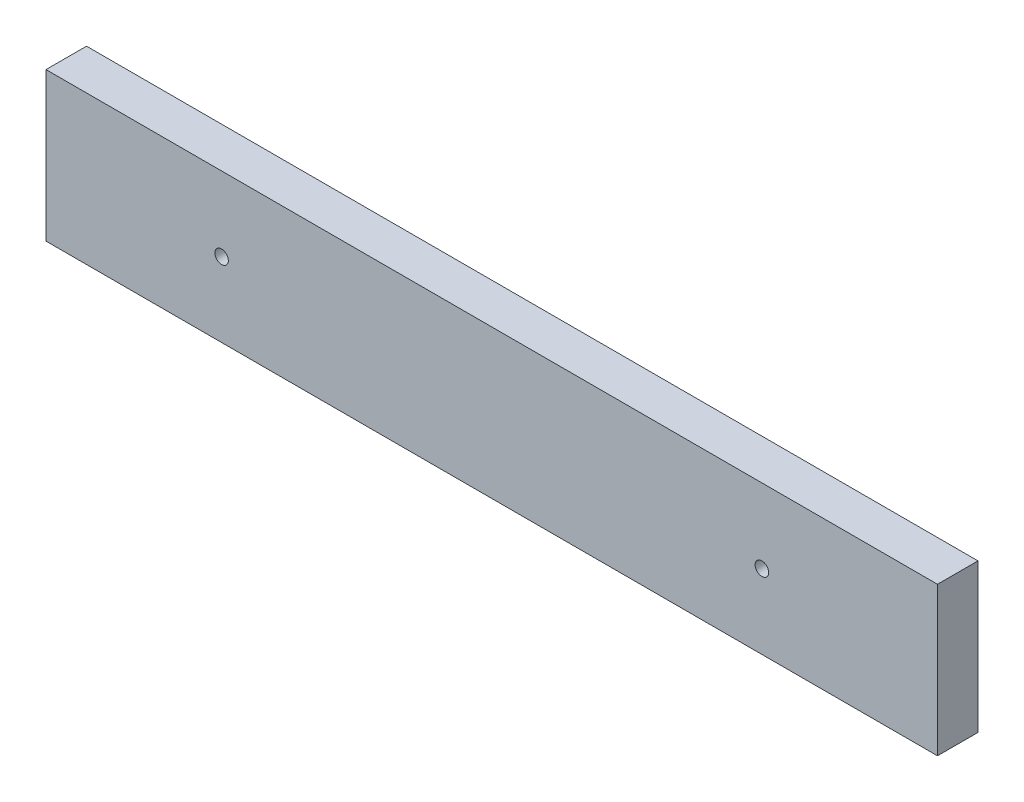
ISO-10303-21;
HEADER;
FILE_DESCRIPTION(('STEP AP214'),'2;1');
FILE_NAME('part.step','',(''),(''),'','','');
FILE_SCHEMA(('AUTOMOTIVE_DESIGN { 1 0 10303 214 1 1 1 1 }'));
ENDSEC;
DATA;
#1=APPLICATION_CONTEXT('core data for automotive mechanical design processes');
#2=APPLICATION_PROTOCOL_DEFINITION('international standard','automotive_design',2000,#1);
#3=PRODUCT_CONTEXT('',#1,'mechanical');
#4=PRODUCT('Part','Part','',(#3));
#5=PRODUCT_RELATED_PRODUCT_CATEGORY('part','',(#4));
#6=PRODUCT_DEFINITION_FORMATION('','',#4);
#7=PRODUCT_DEFINITION_CONTEXT('part definition',#1,'design');
#8=PRODUCT_DEFINITION('design','',#6,#7);
#9=PRODUCT_DEFINITION_SHAPE('','',#8);
#10=(LENGTH_UNIT() NAMED_UNIT(*) SI_UNIT(.MILLI.,.METRE.));
#11=(NAMED_UNIT(*) PLANE_ANGLE_UNIT() SI_UNIT($,.RADIAN.));
#12=(NAMED_UNIT(*) SI_UNIT($,.STERADIAN.) SOLID_ANGLE_UNIT());
#13=UNCERTAINTY_MEASURE_WITH_UNIT(LENGTH_MEASURE(1.E-05),#10,'distance_accuracy_value','');
#14=(GEOMETRIC_REPRESENTATION_CONTEXT(3) GLOBAL_UNCERTAINTY_ASSIGNED_CONTEXT((#13)) GLOBAL_UNIT_ASSIGNED_CONTEXT((#10,
#11,#12)) REPRESENTATION_CONTEXT('',''));
#15=CARTESIAN_POINT('',(0.,0.,0.));
#16=DIRECTION('',(0.,0.,1.));
#17=DIRECTION('',(1.,0.,0.));
#18=AXIS2_PLACEMENT_3D('',#15,#16,#17);
#19=CARTESIAN_POINT('',(838.2,69.85,-19.05));
#20=DIRECTION('',(0.,0.,1.));
#21=DIRECTION('',(0.,-1.,0.));
#22=AXIS2_PLACEMENT_3D('',#19,#20,#21);
#23=PLANE('',#22);
#24=CARTESIAN_POINT('',(165.1,0.,-19.05));
#25=DIRECTION('',(0.,0.,1.));
#26=DIRECTION('',(1.,0.,0.));
#27=AXIS2_PLACEMENT_3D('',#24,#25,#26);
#28=CIRCLE('',#27,6.35);
#29=CARTESIAN_POINT('',(171.45,0.,-19.05));
#30=VERTEX_POINT('',#29);
#31=EDGE_CURVE('E105',#30,#30,#28,.T.);
#32=ORIENTED_EDGE('',*,*,#31,.T.);
#33=EDGE_LOOP('',(#32));
#34=FACE_BOUND('',#33,.T.);
#35=CARTESIAN_POINT('',(673.1,0.,-19.05));
#36=DIRECTION('',(0.,0.,1.));
#37=DIRECTION('',(1.,0.,0.));
#38=AXIS2_PLACEMENT_3D('',#35,#36,#37);
#39=CIRCLE('',#38,6.34999999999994);
#40=CARTESIAN_POINT('',(679.45,0.,-19.05));
#41=VERTEX_POINT('',#40);
#42=EDGE_CURVE('E116',#41,#41,#39,.T.);
#43=ORIENTED_EDGE('',*,*,#42,.T.);
#44=EDGE_LOOP('',(#43));
#45=FACE_BOUND('',#44,.T.);
#46=DIRECTION('',(0.,1.,0.));
#47=VECTOR('',#46,1.);
#48=CARTESIAN_POINT('',(0.,69.85,-19.05));
#49=LINE('',#48,#47);
#50=CARTESIAN_POINT('',(0.,-69.85,-19.05));
#51=VERTEX_POINT('',#50);
#52=CARTESIAN_POINT('',(0.,69.85,-19.05));
#53=VERTEX_POINT('',#52);
#54=EDGE_CURVE('E102',#51,#53,#49,.T.);
#55=ORIENTED_EDGE('',*,*,#54,.T.);
#56=DIRECTION('',(-1.,0.,0.));
#57=VECTOR('',#56,1.);
#58=CARTESIAN_POINT('',(838.2,69.85,-19.05));
#59=LINE('',#58,#57);
#60=CARTESIAN_POINT('',(838.2,69.85,-19.05));
#61=VERTEX_POINT('',#60);
#62=EDGE_CURVE('E11',#61,#53,#59,.T.);
#63=ORIENTED_EDGE('',*,*,#62,.F.);
#64=DIRECTION('',(0.,1.,0.));
#65=VECTOR('',#64,1.);
#66=CARTESIAN_POINT('',(838.2,69.85,-19.05));
#67=LINE('',#66,#65);
#68=CARTESIAN_POINT('',(838.2,-69.85,-19.05));
#69=VERTEX_POINT('',#68);
#70=EDGE_CURVE('E90',#69,#61,#67,.T.);
#71=ORIENTED_EDGE('',*,*,#70,.F.);
#72=DIRECTION('',(-1.,0.,0.));
#73=VECTOR('',#72,1.);
#74=CARTESIAN_POINT('',(838.2,-69.85,-19.05));
#75=LINE('',#74,#73);
#76=EDGE_CURVE('E98',#69,#51,#75,.T.);
#77=ORIENTED_EDGE('',*,*,#76,.T.);
#78=EDGE_LOOP('',(#55,#63,#71,#77));
#79=FACE_BOUND('',#78,.T.);
#80=ADVANCED_FACE('F39',(#34,#45,#79),#23,.F.);
#81=CARTESIAN_POINT('',(838.2,69.85,19.05));
#82=DIRECTION('',(0.,-1.,0.));
#83=DIRECTION('',(0.,0.,-1.));
#84=AXIS2_PLACEMENT_3D('',#81,#82,#83);
#85=PLANE('',#84);
#86=DIRECTION('',(0.,0.,1.));
#87=VECTOR('',#86,1.);
#88=CARTESIAN_POINT('',(0.,69.85,19.05));
#89=LINE('',#88,#87);
#90=CARTESIAN_POINT('',(0.,69.85,19.05));
#91=VERTEX_POINT('',#90);
#92=EDGE_CURVE('E94',#53,#91,#89,.T.);
#93=ORIENTED_EDGE('',*,*,#92,.T.);
#94=DIRECTION('',(-1.,0.,0.));
#95=VECTOR('',#94,1.);
#96=CARTESIAN_POINT('',(838.2,69.85,19.05));
#97=LINE('',#96,#95);
#98=CARTESIAN_POINT('',(838.2,69.85,19.05));
#99=VERTEX_POINT('',#98);
#100=EDGE_CURVE('E47',#99,#91,#97,.T.);
#101=ORIENTED_EDGE('',*,*,#100,.F.);
#102=DIRECTION('',(0.,0.,1.));
#103=VECTOR('',#102,1.);
#104=CARTESIAN_POINT('',(838.2,69.85,19.05));
#105=LINE('',#104,#103);
#106=EDGE_CURVE('E85',#61,#99,#105,.T.);
#107=ORIENTED_EDGE('',*,*,#106,.F.);
#108=ORIENTED_EDGE('',*,*,#62,.T.);
#109=EDGE_LOOP('',(#93,#101,#107,#108));
#110=FACE_BOUND('',#109,.T.);
#111=ADVANCED_FACE('F93',(#110),#85,.F.);
#112=CARTESIAN_POINT('',(838.2,69.85,19.05));
#113=DIRECTION('',(0.,0.,-1.));
#114=DIRECTION('',(0.,1.,0.));
#115=AXIS2_PLACEMENT_3D('',#112,#113,#114);
#116=PLANE('',#115);
#117=CARTESIAN_POINT('',(165.1,0.,19.05));
#118=DIRECTION('',(0.,0.,1.));
#119=DIRECTION('',(1.,0.,0.));
#120=AXIS2_PLACEMENT_3D('',#117,#118,#119);
#121=CIRCLE('',#120,6.35);
#122=CARTESIAN_POINT('',(171.45,0.,19.05));
#123=VERTEX_POINT('',#122);
#124=EDGE_CURVE('E122',#123,#123,#121,.T.);
#125=ORIENTED_EDGE('',*,*,#124,.F.);
#126=EDGE_LOOP('',(#125));
#127=FACE_BOUND('',#126,.T.);
#128=CARTESIAN_POINT('',(673.1,0.,19.05));
#129=DIRECTION('',(0.,0.,1.));
#130=DIRECTION('',(1.,0.,0.));
#131=AXIS2_PLACEMENT_3D('',#128,#129,#130);
#132=CIRCLE('',#131,6.34999999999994);
#133=CARTESIAN_POINT('',(679.45,0.,19.05));
#134=VERTEX_POINT('',#133);
#135=EDGE_CURVE('E119',#134,#134,#132,.T.);
#136=ORIENTED_EDGE('',*,*,#135,.F.);
#137=EDGE_LOOP('',(#136));
#138=FACE_BOUND('',#137,.T.);
#139=DIRECTION('',(0.,-1.,0.));
#140=VECTOR('',#139,1.);
#141=CARTESIAN_POINT('',(0.,69.85,19.05));
#142=LINE('',#141,#140);
#143=CARTESIAN_POINT('',(0.,-69.85,19.05));
#144=VERTEX_POINT('',#143);
#145=EDGE_CURVE('E72',#91,#144,#142,.T.);
#146=ORIENTED_EDGE('',*,*,#145,.T.);
#147=DIRECTION('',(-1.,0.,0.));
#148=VECTOR('',#147,1.);
#149=CARTESIAN_POINT('',(838.2,-69.85,19.05));
#150=LINE('',#149,#148);
#151=CARTESIAN_POINT('',(838.2,-69.85,19.05));
#152=VERTEX_POINT('',#151);
#153=EDGE_CURVE('E95',#152,#144,#150,.T.);
#154=ORIENTED_EDGE('',*,*,#153,.F.);
#155=DIRECTION('',(0.,-1.,0.));
#156=VECTOR('',#155,1.);
#157=CARTESIAN_POINT('',(838.2,69.85,19.05));
#158=LINE('',#157,#156);
#159=EDGE_CURVE('E88',#99,#152,#158,.T.);
#160=ORIENTED_EDGE('',*,*,#159,.F.);
#161=ORIENTED_EDGE('',*,*,#100,.T.);
#162=EDGE_LOOP('',(#146,#154,#160,#161));
#163=FACE_BOUND('',#162,.T.);
#164=ADVANCED_FACE('F96',(#127,#138,#163),#116,.F.);
#165=CARTESIAN_POINT('',(838.2,-69.85,19.05));
#166=DIRECTION('',(0.,1.,0.));
#167=DIRECTION('',(0.,0.,1.));
#168=AXIS2_PLACEMENT_3D('',#165,#166,#167);
#169=PLANE('',#168);
#170=DIRECTION('',(0.,0.,-1.));
#171=VECTOR('',#170,1.);
#172=CARTESIAN_POINT('',(0.,-69.85,19.05));
#173=LINE('',#172,#171);
#174=EDGE_CURVE('E78',#144,#51,#173,.T.);
#175=ORIENTED_EDGE('',*,*,#174,.T.);
#176=ORIENTED_EDGE('',*,*,#76,.F.);
#177=DIRECTION('',(0.,0.,-1.));
#178=VECTOR('',#177,1.);
#179=CARTESIAN_POINT('',(838.2,-69.85,19.05));
#180=LINE('',#179,#178);
#181=EDGE_CURVE('E55',#152,#69,#180,.T.);
#182=ORIENTED_EDGE('',*,*,#181,.F.);
#183=ORIENTED_EDGE('',*,*,#153,.T.);
#184=EDGE_LOOP('',(#175,#176,#182,#183));
#185=FACE_BOUND('',#184,.T.);
#186=ADVANCED_FACE('F110',(#185),#169,.F.);
#187=CARTESIAN_POINT('',(838.2,0.,0.));
#188=DIRECTION('',(1.,0.,0.));
#189=DIRECTION('',(0.,0.,-1.));
#190=AXIS2_PLACEMENT_3D('',#187,#188,#189);
#191=PLANE('',#190);
#192=ORIENTED_EDGE('',*,*,#70,.T.);
#193=ORIENTED_EDGE('',*,*,#106,.T.);
#194=ORIENTED_EDGE('',*,*,#159,.T.);
#195=ORIENTED_EDGE('',*,*,#181,.T.);
#196=EDGE_LOOP('',(#192,#193,#194,#195));
#197=FACE_BOUND('',#196,.T.);
#198=ADVANCED_FACE('F86',(#197),#191,.T.);
#199=CARTESIAN_POINT('',(0.,0.,0.));
#200=DIRECTION('',(1.,0.,0.));
#201=DIRECTION('',(0.,0.,-1.));
#202=AXIS2_PLACEMENT_3D('',#199,#200,#201);
#203=PLANE('',#202);
#204=ORIENTED_EDGE('',*,*,#54,.F.);
#205=ORIENTED_EDGE('',*,*,#174,.F.);
#206=ORIENTED_EDGE('',*,*,#145,.F.);
#207=ORIENTED_EDGE('',*,*,#92,.F.);
#208=EDGE_LOOP('',(#204,#205,#206,#207));
#209=FACE_BOUND('',#208,.T.);
#210=ADVANCED_FACE('F113',(#209),#203,.F.);
#211=CARTESIAN_POINT('',(673.1,0.,-19.05));
#212=DIRECTION('',(0.,0.,1.));
#213=DIRECTION('',(1.,0.,0.));
#214=AXIS2_PLACEMENT_3D('',#211,#212,#213);
#215=CYLINDRICAL_SURFACE('',#214,6.34999999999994);
#216=ORIENTED_EDGE('',*,*,#42,.F.);
#217=EDGE_LOOP('',(#216));
#218=FACE_BOUND('',#217,.T.);
#219=ORIENTED_EDGE('',*,*,#135,.T.);
#220=EDGE_LOOP('',(#219));
#221=FACE_BOUND('',#220,.T.);
#222=ADVANCED_FACE('F133',(#218,#221),#215,.F.);
#223=CARTESIAN_POINT('',(165.1,0.,-19.05));
#224=DIRECTION('',(0.,0.,1.));
#225=DIRECTION('',(1.,0.,0.));
#226=AXIS2_PLACEMENT_3D('',#223,#224,#225);
#227=CYLINDRICAL_SURFACE('',#226,6.35);
#228=ORIENTED_EDGE('',*,*,#31,.F.);
#229=EDGE_LOOP('',(#228));
#230=FACE_BOUND('',#229,.T.);
#231=ORIENTED_EDGE('',*,*,#124,.T.);
#232=EDGE_LOOP('',(#231));
#233=FACE_BOUND('',#232,.T.);
#234=ADVANCED_FACE('F130',(#230,#233),#227,.F.);
#235=CLOSED_SHELL('',(#80,#111,#164,#186,#198,#210,#222,#234));
#236=MANIFOLD_SOLID_BREP('B2',#235);
#237=ADVANCED_BREP_SHAPE_REPRESENTATION('',(#18,#236),#14);
#238=SHAPE_DEFINITION_REPRESENTATION(#9,#237);
ENDSEC;
END-ISO-10303-21;
